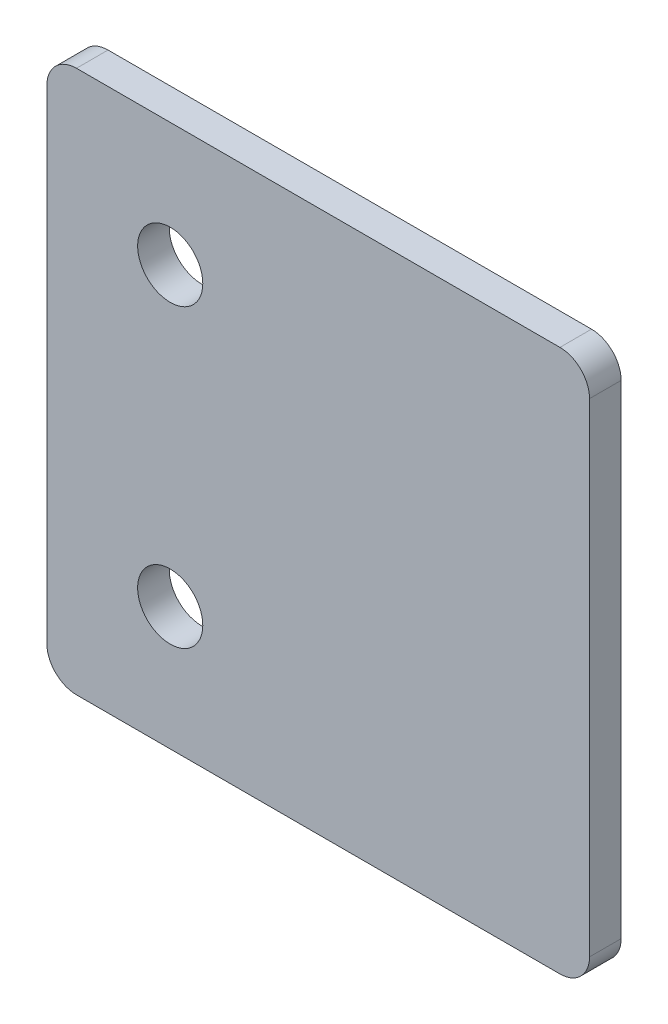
ISO-10303-21;
HEADER;
FILE_DESCRIPTION(('STEP AP214'),'2;1');
FILE_NAME('part.step','',(''),(''),'','','');
FILE_SCHEMA(('AUTOMOTIVE_DESIGN { 1 0 10303 214 1 1 1 1 }'));
ENDSEC;
DATA;
#1=APPLICATION_CONTEXT('core data for automotive mechanical design processes');
#2=APPLICATION_PROTOCOL_DEFINITION('international standard','automotive_design',2000,#1);
#3=PRODUCT_CONTEXT('',#1,'mechanical');
#4=PRODUCT('Part','Part','',(#3));
#5=PRODUCT_RELATED_PRODUCT_CATEGORY('part','',(#4));
#6=PRODUCT_DEFINITION_FORMATION('','',#4);
#7=PRODUCT_DEFINITION_CONTEXT('part definition',#1,'design');
#8=PRODUCT_DEFINITION('design','',#6,#7);
#9=PRODUCT_DEFINITION_SHAPE('','',#8);
#10=(LENGTH_UNIT() NAMED_UNIT(*) SI_UNIT(.MILLI.,.METRE.));
#11=(NAMED_UNIT(*) PLANE_ANGLE_UNIT() SI_UNIT($,.RADIAN.));
#12=(NAMED_UNIT(*) SI_UNIT($,.STERADIAN.) SOLID_ANGLE_UNIT());
#13=UNCERTAINTY_MEASURE_WITH_UNIT(LENGTH_MEASURE(1.E-05),#10,'distance_accuracy_value','');
#14=(GEOMETRIC_REPRESENTATION_CONTEXT(3) GLOBAL_UNCERTAINTY_ASSIGNED_CONTEXT((#13)) GLOBAL_UNIT_ASSIGNED_CONTEXT((#10,
#11,#12)) REPRESENTATION_CONTEXT('',''));
#15=CARTESIAN_POINT('',(0.,0.,0.));
#16=DIRECTION('',(0.,0.,1.));
#17=DIRECTION('',(1.,0.,0.));
#18=AXIS2_PLACEMENT_3D('',#15,#16,#17);
#19=CARTESIAN_POINT('',(3.,52.,3.2));
#20=DIRECTION('',(0.,0.,-1.));
#21=DIRECTION('',(-1.,0.,0.));
#22=AXIS2_PLACEMENT_3D('',#19,#20,#21);
#23=CYLINDRICAL_SURFACE('',#22,3.);
#24=CARTESIAN_POINT('',(3.,52.,0.));
#25=DIRECTION('',(0.,0.,1.));
#26=DIRECTION('',(1.,0.,0.));
#27=AXIS2_PLACEMENT_3D('',#24,#25,#26);
#28=CIRCLE('',#27,3.);
#29=CARTESIAN_POINT('',(3.,55.,0.));
#30=VERTEX_POINT('',#29);
#31=CARTESIAN_POINT('',(0.,52.,0.));
#32=VERTEX_POINT('',#31);
#33=EDGE_CURVE('E132',#30,#32,#28,.T.);
#34=ORIENTED_EDGE('',*,*,#33,.T.);
#35=DIRECTION('',(0.,0.,-1.));
#36=VECTOR('',#35,1.);
#37=CARTESIAN_POINT('',(0.,52.,3.2));
#38=LINE('',#37,#36);
#39=CARTESIAN_POINT('',(0.,52.,3.2));
#40=VERTEX_POINT('',#39);
#41=EDGE_CURVE('E11',#40,#32,#38,.T.);
#42=ORIENTED_EDGE('',*,*,#41,.F.);
#43=CARTESIAN_POINT('',(3.,52.,3.2));
#44=DIRECTION('',(0.,0.,1.));
#45=DIRECTION('',(1.,0.,0.));
#46=AXIS2_PLACEMENT_3D('',#43,#44,#45);
#47=CIRCLE('',#46,3.);
#48=CARTESIAN_POINT('',(3.,55.,3.2));
#49=VERTEX_POINT('',#48);
#50=EDGE_CURVE('E147',#49,#40,#47,.T.);
#51=ORIENTED_EDGE('',*,*,#50,.F.);
#52=DIRECTION('',(0.,0.,-1.));
#53=VECTOR('',#52,1.);
#54=CARTESIAN_POINT('',(3.,55.,3.2));
#55=LINE('',#54,#53);
#56=EDGE_CURVE('E128',#49,#30,#55,.T.);
#57=ORIENTED_EDGE('',*,*,#56,.T.);
#58=EDGE_LOOP('',(#34,#42,#51,#57));
#59=FACE_BOUND('',#58,.T.);
#60=ADVANCED_FACE('F34',(#59),#23,.T.);
#61=CARTESIAN_POINT('',(0.,3.,3.2));
#62=DIRECTION('',(1.,0.,0.));
#63=DIRECTION('',(0.,0.,-1.));
#64=AXIS2_PLACEMENT_3D('',#61,#62,#63);
#65=PLANE('',#64);
#66=DIRECTION('',(0.,-1.,0.));
#67=VECTOR('',#66,1.);
#68=CARTESIAN_POINT('',(0.,3.,0.));
#69=LINE('',#68,#67);
#70=CARTESIAN_POINT('',(0.,3.,0.));
#71=VERTEX_POINT('',#70);
#72=EDGE_CURVE('E135',#32,#71,#69,.T.);
#73=ORIENTED_EDGE('',*,*,#72,.T.);
#74=DIRECTION('',(0.,0.,-1.));
#75=VECTOR('',#74,1.);
#76=CARTESIAN_POINT('',(0.,3.,3.2));
#77=LINE('',#76,#75);
#78=CARTESIAN_POINT('',(0.,3.,3.2));
#79=VERTEX_POINT('',#78);
#80=EDGE_CURVE('E43',#79,#71,#77,.T.);
#81=ORIENTED_EDGE('',*,*,#80,.F.);
#82=DIRECTION('',(0.,-1.,0.));
#83=VECTOR('',#82,1.);
#84=CARTESIAN_POINT('',(0.,3.,3.2));
#85=LINE('',#84,#83);
#86=EDGE_CURVE('E95',#40,#79,#85,.T.);
#87=ORIENTED_EDGE('',*,*,#86,.F.);
#88=ORIENTED_EDGE('',*,*,#41,.T.);
#89=EDGE_LOOP('',(#73,#81,#87,#88));
#90=FACE_BOUND('',#89,.T.);
#91=ADVANCED_FACE('F204',(#90),#65,.F.);
#92=CARTESIAN_POINT('',(3.,3.,3.2));
#93=DIRECTION('',(0.,0.,-1.));
#94=DIRECTION('',(-1.,0.,0.));
#95=AXIS2_PLACEMENT_3D('',#92,#93,#94);
#96=CYLINDRICAL_SURFACE('',#95,3.);
#97=CARTESIAN_POINT('',(3.,3.,0.));
#98=DIRECTION('',(0.,0.,1.));
#99=DIRECTION('',(-1.,0.,0.));
#100=AXIS2_PLACEMENT_3D('',#97,#98,#99);
#101=CIRCLE('',#100,3.);
#102=CARTESIAN_POINT('',(3.,0.,0.));
#103=VERTEX_POINT('',#102);
#104=EDGE_CURVE('E138',#71,#103,#101,.T.);
#105=ORIENTED_EDGE('',*,*,#104,.T.);
#106=DIRECTION('',(0.,0.,-1.));
#107=VECTOR('',#106,1.);
#108=CARTESIAN_POINT('',(3.,0.,3.2));
#109=LINE('',#108,#107);
#110=CARTESIAN_POINT('',(3.,0.,3.2));
#111=VERTEX_POINT('',#110);
#112=EDGE_CURVE('E154',#111,#103,#109,.T.);
#113=ORIENTED_EDGE('',*,*,#112,.F.);
#114=CARTESIAN_POINT('',(3.,3.,3.2));
#115=DIRECTION('',(0.,0.,1.));
#116=DIRECTION('',(-1.,0.,0.));
#117=AXIS2_PLACEMENT_3D('',#114,#115,#116);
#118=CIRCLE('',#117,3.);
#119=EDGE_CURVE('E172',#79,#111,#118,.T.);
#120=ORIENTED_EDGE('',*,*,#119,.F.);
#121=ORIENTED_EDGE('',*,*,#80,.T.);
#122=EDGE_LOOP('',(#105,#113,#120,#121));
#123=FACE_BOUND('',#122,.T.);
#124=ADVANCED_FACE('F208',(#123),#96,.T.);
#125=CARTESIAN_POINT('',(3.,0.,3.2));
#126=DIRECTION('',(0.,1.,0.));
#127=DIRECTION('',(0.,0.,1.));
#128=AXIS2_PLACEMENT_3D('',#125,#126,#127);
#129=PLANE('',#128);
#130=DIRECTION('',(1.,0.,0.));
#131=VECTOR('',#130,1.);
#132=CARTESIAN_POINT('',(3.,0.,0.));
#133=LINE('',#132,#131);
#134=CARTESIAN_POINT('',(52.,0.,0.));
#135=VERTEX_POINT('',#134);
#136=EDGE_CURVE('E140',#103,#135,#133,.T.);
#137=ORIENTED_EDGE('',*,*,#136,.T.);
#138=DIRECTION('',(0.,0.,-1.));
#139=VECTOR('',#138,1.);
#140=CARTESIAN_POINT('',(52.,0.,3.2));
#141=LINE('',#140,#139);
#142=CARTESIAN_POINT('',(52.,0.,3.2));
#143=VERTEX_POINT('',#142);
#144=EDGE_CURVE('E151',#143,#135,#141,.T.);
#145=ORIENTED_EDGE('',*,*,#144,.F.);
#146=DIRECTION('',(1.,0.,0.));
#147=VECTOR('',#146,1.);
#148=CARTESIAN_POINT('',(3.,0.,3.2));
#149=LINE('',#148,#147);
#150=EDGE_CURVE('E174',#111,#143,#149,.T.);
#151=ORIENTED_EDGE('',*,*,#150,.F.);
#152=ORIENTED_EDGE('',*,*,#112,.T.);
#153=EDGE_LOOP('',(#137,#145,#151,#152));
#154=FACE_BOUND('',#153,.T.);
#155=ADVANCED_FACE('F180',(#154),#129,.F.);
#156=CARTESIAN_POINT('',(52.,3.,3.2));
#157=DIRECTION('',(0.,0.,-1.));
#158=DIRECTION('',(-1.,0.,0.));
#159=AXIS2_PLACEMENT_3D('',#156,#157,#158);
#160=CYLINDRICAL_SURFACE('',#159,3.);
#161=CARTESIAN_POINT('',(52.,3.,0.));
#162=DIRECTION('',(0.,0.,1.));
#163=DIRECTION('',(-1.,0.,0.));
#164=AXIS2_PLACEMENT_3D('',#161,#162,#163);
#165=CIRCLE('',#164,3.);
#166=CARTESIAN_POINT('',(55.,3.,0.));
#167=VERTEX_POINT('',#166);
#168=EDGE_CURVE('E142',#135,#167,#165,.T.);
#169=ORIENTED_EDGE('',*,*,#168,.T.);
#170=DIRECTION('',(0.,0.,-1.));
#171=VECTOR('',#170,1.);
#172=CARTESIAN_POINT('',(55.,3.,3.2));
#173=LINE('',#172,#171);
#174=CARTESIAN_POINT('',(55.,3.,3.2));
#175=VERTEX_POINT('',#174);
#176=EDGE_CURVE('E123',#175,#167,#173,.T.);
#177=ORIENTED_EDGE('',*,*,#176,.F.);
#178=CARTESIAN_POINT('',(52.,3.,3.2));
#179=DIRECTION('',(0.,0.,1.));
#180=DIRECTION('',(-1.,0.,0.));
#181=AXIS2_PLACEMENT_3D('',#178,#179,#180);
#182=CIRCLE('',#181,3.);
#183=EDGE_CURVE('E114',#143,#175,#182,.T.);
#184=ORIENTED_EDGE('',*,*,#183,.F.);
#185=ORIENTED_EDGE('',*,*,#144,.T.);
#186=EDGE_LOOP('',(#169,#177,#184,#185));
#187=FACE_BOUND('',#186,.T.);
#188=ADVANCED_FACE('F184',(#187),#160,.T.);
#189=CARTESIAN_POINT('',(55.,3.,3.2));
#190=DIRECTION('',(-1.,0.,0.));
#191=DIRECTION('',(0.,-1.,0.));
#192=AXIS2_PLACEMENT_3D('',#189,#190,#191);
#193=PLANE('',#192);
#194=DIRECTION('',(0.,1.,0.));
#195=VECTOR('',#194,1.);
#196=CARTESIAN_POINT('',(55.,3.,0.));
#197=LINE('',#196,#195);
#198=CARTESIAN_POINT('',(55.,52.,0.));
#199=VERTEX_POINT('',#198);
#200=EDGE_CURVE('E122',#167,#199,#197,.T.);
#201=ORIENTED_EDGE('',*,*,#200,.T.);
#202=DIRECTION('',(0.,0.,-1.));
#203=VECTOR('',#202,1.);
#204=CARTESIAN_POINT('',(55.,52.,3.2));
#205=LINE('',#204,#203);
#206=CARTESIAN_POINT('',(55.,52.,3.2));
#207=VERTEX_POINT('',#206);
#208=EDGE_CURVE('E119',#207,#199,#205,.T.);
#209=ORIENTED_EDGE('',*,*,#208,.F.);
#210=DIRECTION('',(0.,1.,0.));
#211=VECTOR('',#210,1.);
#212=CARTESIAN_POINT('',(55.,3.,3.2));
#213=LINE('',#212,#211);
#214=EDGE_CURVE('E108',#175,#207,#213,.T.);
#215=ORIENTED_EDGE('',*,*,#214,.F.);
#216=ORIENTED_EDGE('',*,*,#176,.T.);
#217=EDGE_LOOP('',(#201,#209,#215,#216));
#218=FACE_BOUND('',#217,.T.);
#219=ADVANCED_FACE('F120',(#218),#193,.F.);
#220=CARTESIAN_POINT('',(52.,52.,3.2));
#221=DIRECTION('',(0.,0.,-1.));
#222=DIRECTION('',(-1.,0.,0.));
#223=AXIS2_PLACEMENT_3D('',#220,#221,#222);
#224=CYLINDRICAL_SURFACE('',#223,3.);
#225=CARTESIAN_POINT('',(52.,52.,0.));
#226=DIRECTION('',(0.,0.,1.));
#227=DIRECTION('',(1.,0.,0.));
#228=AXIS2_PLACEMENT_3D('',#225,#226,#227);
#229=CIRCLE('',#228,3.);
#230=CARTESIAN_POINT('',(52.,55.,0.));
#231=VERTEX_POINT('',#230);
#232=EDGE_CURVE('E81',#199,#231,#229,.T.);
#233=ORIENTED_EDGE('',*,*,#232,.T.);
#234=DIRECTION('',(0.,0.,-1.));
#235=VECTOR('',#234,1.);
#236=CARTESIAN_POINT('',(52.,55.,3.2));
#237=LINE('',#236,#235);
#238=CARTESIAN_POINT('',(52.,55.,3.2));
#239=VERTEX_POINT('',#238);
#240=EDGE_CURVE('E124',#239,#231,#237,.T.);
#241=ORIENTED_EDGE('',*,*,#240,.F.);
#242=CARTESIAN_POINT('',(52.,52.,3.2));
#243=DIRECTION('',(0.,0.,1.));
#244=DIRECTION('',(1.,0.,0.));
#245=AXIS2_PLACEMENT_3D('',#242,#243,#244);
#246=CIRCLE('',#245,3.);
#247=EDGE_CURVE('E112',#207,#239,#246,.T.);
#248=ORIENTED_EDGE('',*,*,#247,.F.);
#249=ORIENTED_EDGE('',*,*,#208,.T.);
#250=EDGE_LOOP('',(#233,#241,#248,#249));
#251=FACE_BOUND('',#250,.T.);
#252=ADVANCED_FACE('F126',(#251),#224,.T.);
#253=CARTESIAN_POINT('',(3.,55.,3.2));
#254=DIRECTION('',(0.,-1.,0.));
#255=DIRECTION('',(0.,0.,-1.));
#256=AXIS2_PLACEMENT_3D('',#253,#254,#255);
#257=PLANE('',#256);
#258=DIRECTION('',(-1.,0.,0.));
#259=VECTOR('',#258,1.);
#260=CARTESIAN_POINT('',(3.,55.,0.));
#261=LINE('',#260,#259);
#262=EDGE_CURVE('E87',#231,#30,#261,.T.);
#263=ORIENTED_EDGE('',*,*,#262,.T.);
#264=ORIENTED_EDGE('',*,*,#56,.F.);
#265=DIRECTION('',(-1.,0.,0.));
#266=VECTOR('',#265,1.);
#267=CARTESIAN_POINT('',(3.,55.,3.2));
#268=LINE('',#267,#266);
#269=EDGE_CURVE('E52',#239,#49,#268,.T.);
#270=ORIENTED_EDGE('',*,*,#269,.F.);
#271=ORIENTED_EDGE('',*,*,#240,.T.);
#272=EDGE_LOOP('',(#263,#264,#270,#271));
#273=FACE_BOUND('',#272,.T.);
#274=ADVANCED_FACE('F192',(#273),#257,.F.);
#275=CARTESIAN_POINT('',(3.,52.,3.2));
#276=DIRECTION('',(0.,0.,1.));
#277=DIRECTION('',(1.,0.,0.));
#278=AXIS2_PLACEMENT_3D('',#275,#276,#277);
#279=PLANE('',#278);
#280=CARTESIAN_POINT('',(12.5,42.5,3.2));
#281=DIRECTION('',(0.,0.,1.));
#282=DIRECTION('',(1.,0.,0.));
#283=AXIS2_PLACEMENT_3D('',#280,#281,#282);
#284=CIRCLE('',#283,3.29999999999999);
#285=CARTESIAN_POINT('',(15.8,42.5,3.2));
#286=VERTEX_POINT('',#285);
#287=EDGE_CURVE('E167',#286,#286,#284,.T.);
#288=ORIENTED_EDGE('',*,*,#287,.F.);
#289=EDGE_LOOP('',(#288));
#290=FACE_BOUND('',#289,.T.);
#291=CARTESIAN_POINT('',(12.5,12.5,3.2));
#292=DIRECTION('',(0.,0.,1.));
#293=DIRECTION('',(1.,0.,0.));
#294=AXIS2_PLACEMENT_3D('',#291,#292,#293);
#295=CIRCLE('',#294,3.29999999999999);
#296=CARTESIAN_POINT('',(15.8,12.5,3.2));
#297=VERTEX_POINT('',#296);
#298=EDGE_CURVE('E159',#297,#297,#295,.T.);
#299=ORIENTED_EDGE('',*,*,#298,.F.);
#300=EDGE_LOOP('',(#299));
#301=FACE_BOUND('',#300,.T.);
#302=ORIENTED_EDGE('',*,*,#50,.T.);
#303=ORIENTED_EDGE('',*,*,#86,.T.);
#304=ORIENTED_EDGE('',*,*,#119,.T.);
#305=ORIENTED_EDGE('',*,*,#150,.T.);
#306=ORIENTED_EDGE('',*,*,#183,.T.);
#307=ORIENTED_EDGE('',*,*,#214,.T.);
#308=ORIENTED_EDGE('',*,*,#247,.T.);
#309=ORIENTED_EDGE('',*,*,#269,.T.);
#310=EDGE_LOOP('',(#302,#303,#304,#305,#306,#307,#308,#309));
#311=FACE_BOUND('',#310,.T.);
#312=ADVANCED_FACE('F110',(#290,#301,#311),#279,.T.);
#313=CARTESIAN_POINT('',(3.,52.,0.));
#314=DIRECTION('',(0.,0.,1.));
#315=DIRECTION('',(1.,0.,0.));
#316=AXIS2_PLACEMENT_3D('',#313,#314,#315);
#317=PLANE('',#316);
#318=CARTESIAN_POINT('',(12.5,42.5,0.));
#319=DIRECTION('',(0.,0.,1.));
#320=DIRECTION('',(1.,0.,0.));
#321=AXIS2_PLACEMENT_3D('',#318,#319,#320);
#322=CIRCLE('',#321,3.29999999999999);
#323=CARTESIAN_POINT('',(15.8,42.5,0.));
#324=VERTEX_POINT('',#323);
#325=EDGE_CURVE('E37',#324,#324,#322,.T.);
#326=ORIENTED_EDGE('',*,*,#325,.T.);
#327=EDGE_LOOP('',(#326));
#328=FACE_BOUND('',#327,.T.);
#329=CARTESIAN_POINT('',(12.5,12.5,0.));
#330=DIRECTION('',(0.,0.,1.));
#331=DIRECTION('',(1.,0.,0.));
#332=AXIS2_PLACEMENT_3D('',#329,#330,#331);
#333=CIRCLE('',#332,3.29999999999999);
#334=CARTESIAN_POINT('',(15.8,12.5,0.));
#335=VERTEX_POINT('',#334);
#336=EDGE_CURVE('E136',#335,#335,#333,.T.);
#337=ORIENTED_EDGE('',*,*,#336,.T.);
#338=EDGE_LOOP('',(#337));
#339=FACE_BOUND('',#338,.T.);
#340=ORIENTED_EDGE('',*,*,#33,.F.);
#341=ORIENTED_EDGE('',*,*,#262,.F.);
#342=ORIENTED_EDGE('',*,*,#232,.F.);
#343=ORIENTED_EDGE('',*,*,#200,.F.);
#344=ORIENTED_EDGE('',*,*,#168,.F.);
#345=ORIENTED_EDGE('',*,*,#136,.F.);
#346=ORIENTED_EDGE('',*,*,#104,.F.);
#347=ORIENTED_EDGE('',*,*,#72,.F.);
#348=EDGE_LOOP('',(#340,#341,#342,#343,#344,#345,#346,#347));
#349=FACE_BOUND('',#348,.T.);
#350=ADVANCED_FACE('F187',(#328,#339,#349),#317,.F.);
#351=CARTESIAN_POINT('',(12.5,12.5,3.2));
#352=DIRECTION('',(0.,0.,1.));
#353=DIRECTION('',(1.,0.,0.));
#354=AXIS2_PLACEMENT_3D('',#351,#352,#353);
#355=CYLINDRICAL_SURFACE('',#354,3.29999999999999);
#356=ORIENTED_EDGE('',*,*,#298,.T.);
#357=EDGE_LOOP('',(#356));
#358=FACE_BOUND('',#357,.T.);
#359=ORIENTED_EDGE('',*,*,#336,.F.);
#360=EDGE_LOOP('',(#359));
#361=FACE_BOUND('',#360,.T.);
#362=ADVANCED_FACE('F247',(#358,#361),#355,.F.);
#363=CARTESIAN_POINT('',(12.5,42.5,3.2));
#364=DIRECTION('',(0.,0.,1.));
#365=DIRECTION('',(1.,0.,0.));
#366=AXIS2_PLACEMENT_3D('',#363,#364,#365);
#367=CYLINDRICAL_SURFACE('',#366,3.29999999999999);
#368=ORIENTED_EDGE('',*,*,#287,.T.);
#369=EDGE_LOOP('',(#368));
#370=FACE_BOUND('',#369,.T.);
#371=ORIENTED_EDGE('',*,*,#325,.F.);
#372=EDGE_LOOP('',(#371));
#373=FACE_BOUND('',#372,.T.);
#374=ADVANCED_FACE('F256',(#370,#373),#367,.F.);
#375=CLOSED_SHELL('',(#60,#91,#124,#155,#188,#219,#252,#274,#312,#350,#362,#374));
#376=MANIFOLD_SOLID_BREP('B2',#375);
#377=ADVANCED_BREP_SHAPE_REPRESENTATION('',(#18,#376),#14);
#378=SHAPE_DEFINITION_REPRESENTATION(#9,#377);
ENDSEC;
END-ISO-10303-21;
